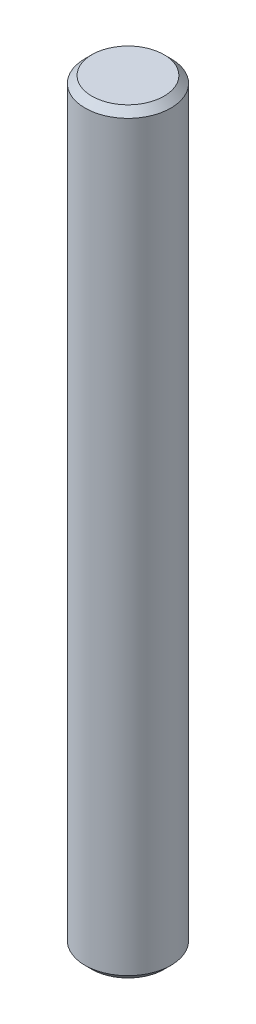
ISO-10303-21;
HEADER;
FILE_DESCRIPTION(('STEP AP214'),'2;1');
FILE_NAME('part.step','',(''),(''),'','','');
FILE_SCHEMA(('AUTOMOTIVE_DESIGN { 1 0 10303 214 1 1 1 1 }'));
ENDSEC;
DATA;
#1=APPLICATION_CONTEXT('core data for automotive mechanical design processes');
#2=APPLICATION_PROTOCOL_DEFINITION('international standard','automotive_design',2000,#1);
#3=PRODUCT_CONTEXT('',#1,'mechanical');
#4=PRODUCT('Part','Part','',(#3));
#5=PRODUCT_RELATED_PRODUCT_CATEGORY('part','',(#4));
#6=PRODUCT_DEFINITION_FORMATION('','',#4);
#7=PRODUCT_DEFINITION_CONTEXT('part definition',#1,'design');
#8=PRODUCT_DEFINITION('design','',#6,#7);
#9=PRODUCT_DEFINITION_SHAPE('','',#8);
#10=(LENGTH_UNIT() NAMED_UNIT(*) SI_UNIT(.MILLI.,.METRE.));
#11=(NAMED_UNIT(*) PLANE_ANGLE_UNIT() SI_UNIT($,.RADIAN.));
#12=(NAMED_UNIT(*) SI_UNIT($,.STERADIAN.) SOLID_ANGLE_UNIT());
#13=UNCERTAINTY_MEASURE_WITH_UNIT(LENGTH_MEASURE(1.E-05),#10,'distance_accuracy_value','');
#14=(GEOMETRIC_REPRESENTATION_CONTEXT(3) GLOBAL_UNCERTAINTY_ASSIGNED_CONTEXT((#13)) GLOBAL_UNIT_ASSIGNED_CONTEXT((#10,
#11,#12)) REPRESENTATION_CONTEXT('',''));
#15=CARTESIAN_POINT('',(0.,0.,0.));
#16=DIRECTION('',(0.,0.,1.));
#17=DIRECTION('',(1.,0.,0.));
#18=AXIS2_PLACEMENT_3D('',#15,#16,#17);
#19=CARTESIAN_POINT('',(0.,13.9954,0.));
#20=DIRECTION('',(0.,-1.,0.));
#21=DIRECTION('',(0.,0.,-1.));
#22=AXIS2_PLACEMENT_3D('',#19,#20,#21);
#23=CYLINDRICAL_SURFACE('',#22,1.5875);
#24=CARTESIAN_POINT('',(0.,-13.7414,0.));
#25=DIRECTION('',(0.,1.,0.));
#26=DIRECTION('',(0.,0.,1.));
#27=AXIS2_PLACEMENT_3D('',#24,#25,#26);
#28=CIRCLE('',#27,1.5875);
#29=CARTESIAN_POINT('',(0.,-13.7414,1.5875));
#30=VERTEX_POINT('',#29);
#31=EDGE_CURVE('E38',#30,#30,#28,.T.);
#32=ORIENTED_EDGE('',*,*,#31,.T.);
#33=EDGE_LOOP('',(#32));
#34=FACE_BOUND('',#33,.T.);
#35=CARTESIAN_POINT('',(0.,13.7414,0.));
#36=DIRECTION('',(0.,1.,0.));
#37=DIRECTION('',(0.,0.,1.));
#38=AXIS2_PLACEMENT_3D('',#35,#36,#37);
#39=CIRCLE('',#38,1.5875);
#40=CARTESIAN_POINT('',(0.,13.7414,1.5875));
#41=VERTEX_POINT('',#40);
#42=EDGE_CURVE('E42',#41,#41,#39,.F.);
#43=ORIENTED_EDGE('',*,*,#42,.T.);
#44=EDGE_LOOP('',(#43));
#45=FACE_BOUND('',#44,.T.);
#46=ADVANCED_FACE('F28',(#34,#45),#23,.T.);
#47=CARTESIAN_POINT('',(0.,13.9954,0.));
#48=DIRECTION('',(0.,1.,0.));
#49=DIRECTION('',(0.,0.,1.));
#50=AXIS2_PLACEMENT_3D('',#47,#48,#49);
#51=PLANE('',#50);
#52=CARTESIAN_POINT('',(0.,13.9954,0.));
#53=DIRECTION('',(0.,1.,0.));
#54=DIRECTION('',(0.,0.,1.));
#55=AXIS2_PLACEMENT_3D('',#52,#53,#54);
#56=CIRCLE('',#55,1.3335);
#57=CARTESIAN_POINT('',(0.,13.9954,1.3335));
#58=VERTEX_POINT('',#57);
#59=EDGE_CURVE('E10',#58,#58,#56,.T.);
#60=ORIENTED_EDGE('',*,*,#59,.T.);
#61=EDGE_LOOP('',(#60));
#62=FACE_BOUND('',#61,.T.);
#63=ADVANCED_FACE('F61',(#62),#51,.T.);
#64=CARTESIAN_POINT('',(0.,-13.9954,0.));
#65=DIRECTION('',(0.,1.,0.));
#66=DIRECTION('',(0.,0.,1.));
#67=AXIS2_PLACEMENT_3D('',#64,#65,#66);
#68=PLANE('',#67);
#69=CARTESIAN_POINT('',(0.,-13.9954,0.));
#70=DIRECTION('',(0.,1.,0.));
#71=DIRECTION('',(0.,0.,1.));
#72=AXIS2_PLACEMENT_3D('',#69,#70,#71);
#73=CIRCLE('',#72,1.3335);
#74=CARTESIAN_POINT('',(0.,-13.9954,1.3335));
#75=VERTEX_POINT('',#74);
#76=EDGE_CURVE('E34',#75,#75,#73,.F.);
#77=ORIENTED_EDGE('',*,*,#76,.T.);
#78=EDGE_LOOP('',(#77));
#79=FACE_BOUND('',#78,.T.);
#80=ADVANCED_FACE('F57',(#79),#68,.F.);
#81=CARTESIAN_POINT('',(0.,-13.7414,0.));
#82=DIRECTION('',(0.,1.,0.));
#83=DIRECTION('',(0.,0.,1.));
#84=AXIS2_PLACEMENT_3D('',#81,#82,#83);
#85=CONICAL_SURFACE('',#84,1.5875,0.785398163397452);
#86=ORIENTED_EDGE('',*,*,#76,.F.);
#87=EDGE_LOOP('',(#86));
#88=FACE_BOUND('',#87,.T.);
#89=ORIENTED_EDGE('',*,*,#31,.F.);
#90=EDGE_LOOP('',(#89));
#91=FACE_BOUND('',#90,.T.);
#92=ADVANCED_FACE('F52',(#88,#91),#85,.T.);
#93=CARTESIAN_POINT('',(0.,13.9954,0.));
#94=DIRECTION('',(0.,-1.,0.));
#95=DIRECTION('',(0.,0.,-1.));
#96=AXIS2_PLACEMENT_3D('',#93,#94,#95);
#97=CONICAL_SURFACE('',#96,1.3335,0.785398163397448);
#98=ORIENTED_EDGE('',*,*,#42,.F.);
#99=EDGE_LOOP('',(#98));
#100=FACE_BOUND('',#99,.T.);
#101=ORIENTED_EDGE('',*,*,#59,.F.);
#102=EDGE_LOOP('',(#101));
#103=FACE_BOUND('',#102,.T.);
#104=ADVANCED_FACE('F49',(#100,#103),#97,.T.);
#105=CLOSED_SHELL('',(#46,#63,#80,#92,#104));
#106=MANIFOLD_SOLID_BREP('B2',#105);
#107=ADVANCED_BREP_SHAPE_REPRESENTATION('',(#18,#106),#14);
#108=SHAPE_DEFINITION_REPRESENTATION(#9,#107);
ENDSEC;
END-ISO-10303-21;
